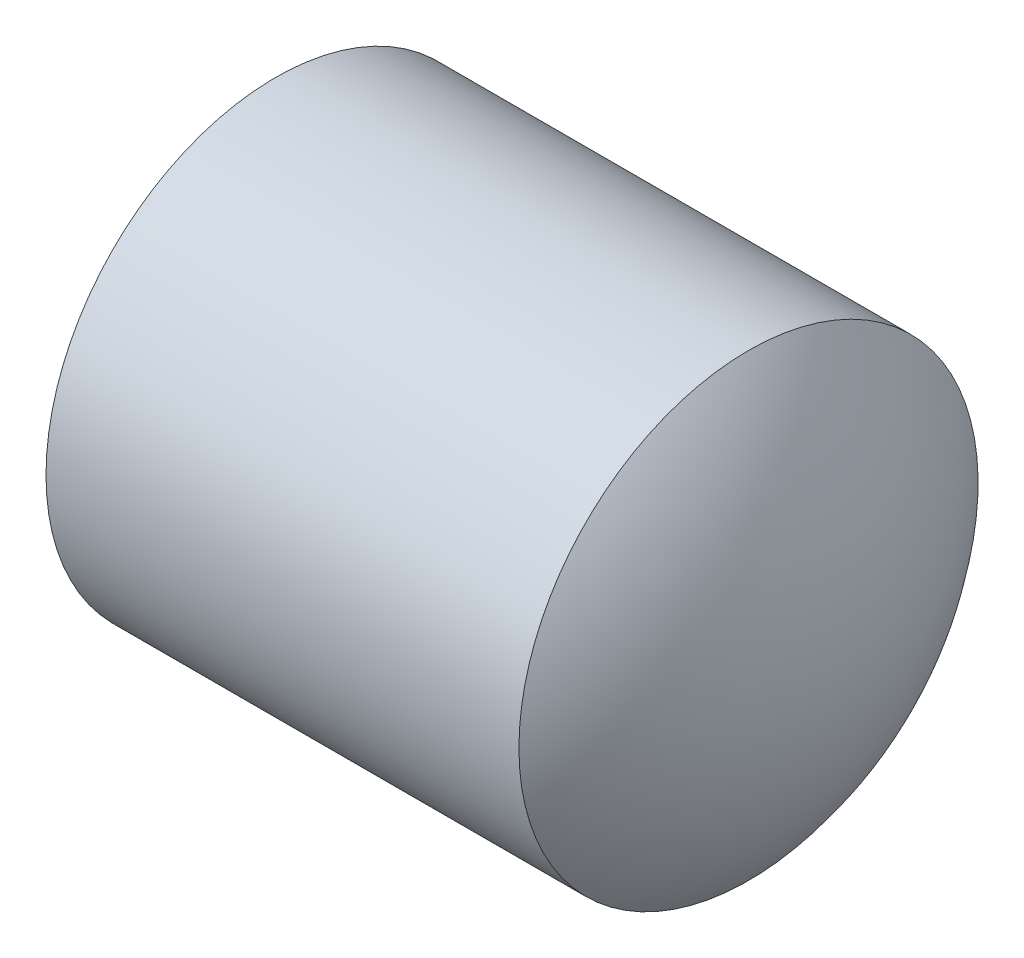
from build123d import *

# Parameters (mm, degrees)
HEX_2_DEPTH = 12


with BuildPart() as part:
    # BodySke → BaseBody (revolve)
    with BuildSketch(Plane.XY, mode=Mode.PRIVATE) as basebody_sk:
        with BuildLine():
            Line((0, 0), (0, 10.352))
            Line((0, 10.352), (0.951473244, 12))
            Line((0.951473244, 12), (25.672042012, 12))
            ThreePointArc((25.672042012, 12), (28.884942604, 6.378307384), (30, 0))
            Line((30, 0), (0, 0))
        make_face()
    revolve(basebody_sk.sketch.rotate(Axis((-12.7, 0, 0), (1, 0, 0)), 90), axis=Axis((-12.7, 0, 0), (1, 0, 0)))

    # Sketch2 → Hex 2 (cut)
    with BuildSketch(Plane.ZY):
        Polygon((3.464101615, 6), (-3.464101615, 6), (-6.92820323, 0), (-3.464101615, -6), (3.464101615, -6), (6.92820323, 0), align=None)
    extrude(amount=-HEX_2_DEPTH, mode=Mode.SUBTRACT)


solid = part.part
